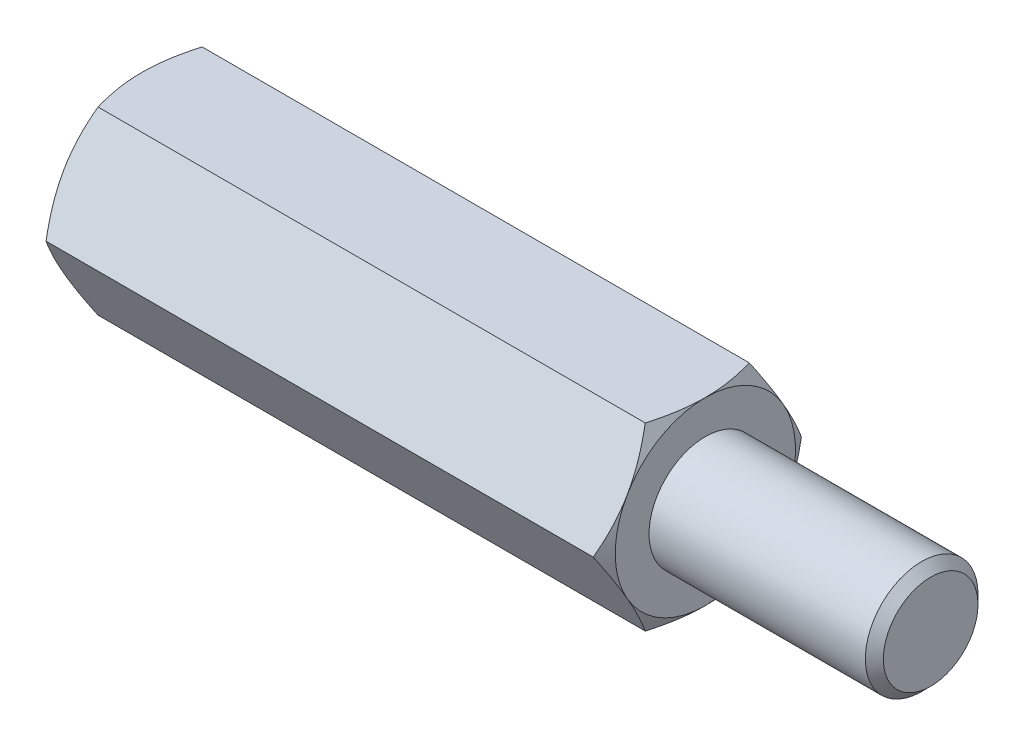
ISO-10303-21;
HEADER;
FILE_DESCRIPTION(('STEP AP214'),'2;1');
FILE_NAME('part.step','',(''),(''),'','','');
FILE_SCHEMA(('AUTOMOTIVE_DESIGN { 1 0 10303 214 1 1 1 1 }'));
ENDSEC;
DATA;
#1=APPLICATION_CONTEXT('core data for automotive mechanical design processes');
#2=APPLICATION_PROTOCOL_DEFINITION('international standard','automotive_design',2000,#1);
#3=PRODUCT_CONTEXT('',#1,'mechanical');
#4=PRODUCT('Part','Part','',(#3));
#5=PRODUCT_RELATED_PRODUCT_CATEGORY('part','',(#4));
#6=PRODUCT_DEFINITION_FORMATION('','',#4);
#7=PRODUCT_DEFINITION_CONTEXT('part definition',#1,'design');
#8=PRODUCT_DEFINITION('design','',#6,#7);
#9=PRODUCT_DEFINITION_SHAPE('','',#8);
#10=(LENGTH_UNIT() NAMED_UNIT(*) SI_UNIT(.MILLI.,.METRE.));
#11=(NAMED_UNIT(*) PLANE_ANGLE_UNIT() SI_UNIT($,.RADIAN.));
#12=(NAMED_UNIT(*) SI_UNIT($,.STERADIAN.) SOLID_ANGLE_UNIT());
#13=UNCERTAINTY_MEASURE_WITH_UNIT(LENGTH_MEASURE(1.E-05),#10,'distance_accuracy_value','');
#14=(GEOMETRIC_REPRESENTATION_CONTEXT(3) GLOBAL_UNCERTAINTY_ASSIGNED_CONTEXT((#13)) GLOBAL_UNIT_ASSIGNED_CONTEXT((#10,
#11,#12)) REPRESENTATION_CONTEXT('',''));
#15=CARTESIAN_POINT('',(0.,0.,0.));
#16=DIRECTION('',(0.,0.,1.));
#17=DIRECTION('',(1.,0.,0.));
#18=AXIS2_PLACEMENT_3D('',#15,#16,#17);
#19=CARTESIAN_POINT('',(12.5,4.,-2.3094010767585));
#20=DIRECTION('',(1.,0.,0.));
#21=DIRECTION('',(0.,0.,-1.));
#22=AXIS2_PLACEMENT_3D('',#19,#20,#21);
#23=PLANE('',#22);
#24=CARTESIAN_POINT('',(12.5,0.,0.));
#25=DIRECTION('',(1.,0.,0.));
#26=DIRECTION('',(0.,0.,-1.));
#27=AXIS2_PLACEMENT_3D('',#24,#25,#26);
#28=CIRCLE('',#27,4.);
#29=CARTESIAN_POINT('',(12.5,-2.,-3.46410161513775));
#30=VERTEX_POINT('',#29);
#31=CARTESIAN_POINT('',(12.5,2.,-3.46410161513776));
#32=VERTEX_POINT('',#31);
#33=EDGE_CURVE('E288',#30,#32,#28,.T.);
#34=ORIENTED_EDGE('',*,*,#33,.T.);
#35=CARTESIAN_POINT('',(12.5,4.,0.));
#36=VERTEX_POINT('',#35);
#37=EDGE_CURVE('E53',#32,#36,#28,.T.);
#38=ORIENTED_EDGE('',*,*,#37,.T.);
#39=CARTESIAN_POINT('',(12.5,2.,3.46410161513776));
#40=VERTEX_POINT('',#39);
#41=EDGE_CURVE('E297',#36,#40,#28,.T.);
#42=ORIENTED_EDGE('',*,*,#41,.T.);
#43=CARTESIAN_POINT('',(12.5,-2.,3.46410161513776));
#44=VERTEX_POINT('',#43);
#45=EDGE_CURVE('E303',#40,#44,#28,.T.);
#46=ORIENTED_EDGE('',*,*,#45,.T.);
#47=CARTESIAN_POINT('',(12.5,0.,0.));
#48=DIRECTION('',(-1.,0.,0.));
#49=DIRECTION('',(0.,-1.,0.));
#50=AXIS2_PLACEMENT_3D('',#47,#48,#49);
#51=CIRCLE('',#50,4.);
#52=CARTESIAN_POINT('',(12.5,-4.,0.));
#53=VERTEX_POINT('',#52);
#54=EDGE_CURVE('E193',#53,#44,#51,.T.);
#55=ORIENTED_EDGE('',*,*,#54,.F.);
#56=EDGE_CURVE('E61',#53,#30,#28,.T.);
#57=ORIENTED_EDGE('',*,*,#56,.T.);
#58=EDGE_LOOP('',(#34,#38,#42,#46,#55,#57));
#59=FACE_BOUND('',#58,.T.);
#60=CARTESIAN_POINT('',(12.5,0.,0.));
#61=DIRECTION('',(1.,0.,0.));
#62=DIRECTION('',(0.,0.,-1.));
#63=AXIS2_PLACEMENT_3D('',#60,#61,#62);
#64=CIRCLE('',#63,2.5);
#65=CARTESIAN_POINT('',(12.5,0.,-2.5));
#66=VERTEX_POINT('',#65);
#67=EDGE_CURVE('E458',#66,#66,#64,.T.);
#68=ORIENTED_EDGE('',*,*,#67,.F.);
#69=EDGE_LOOP('',(#68));
#70=FACE_BOUND('',#69,.T.);
#71=ADVANCED_FACE('F37',(#59,#70),#23,.T.);
#72=CARTESIAN_POINT('',(12.5,0.,-4.61880215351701));
#73=DIRECTION('',(0.,-0.5,0.866025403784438));
#74=DIRECTION('',(0.,-0.866025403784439,-0.5));
#75=AXIS2_PLACEMENT_3D('',#72,#73,#74);
#76=PLANE('',#75);
#77=CARTESIAN_POINT('',(12.1426677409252,-0.000200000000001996,-4.61891762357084));
#78=CARTESIAN_POINT('',(12.2012821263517,0.175579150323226,-4.5174314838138));
#79=CARTESIAN_POINT('',(12.2545896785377,0.352875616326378,-4.41506932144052));
#80=CARTESIAN_POINT('',(12.3476383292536,0.710538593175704,-4.2085725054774));
#81=CARTESIAN_POINT('',(12.3873465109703,0.890911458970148,-4.10443418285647));
#82=CARTESIAN_POINT('',(12.4491577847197,1.24942181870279,-3.89744813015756));
#83=CARTESIAN_POINT('',(12.4716722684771,1.42750415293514,-3.79463224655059));
#84=CARTESIAN_POINT('',(12.4985493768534,1.78450671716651,-3.58851671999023));
#85=CARTESIAN_POINT('',(12.5029342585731,1.9634256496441,-3.48521782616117));
#86=CARTESIAN_POINT('',(12.49380992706,2.29774284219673,-3.29219970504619));
#87=CARTESIAN_POINT('',(12.482541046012,2.45319115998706,-3.20245157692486));
#88=CARTESIAN_POINT('',(12.4468260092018,2.76307505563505,-3.02354002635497));
#89=CARTESIAN_POINT('',(12.4223676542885,2.91750956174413,-2.93437722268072));
#90=CARTESIAN_POINT('',(12.3612239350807,3.22803232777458,-2.75509682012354));
#91=CARTESIAN_POINT('',(12.3242793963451,3.3840812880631,-2.6650019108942));
#92=CARTESIAN_POINT('',(12.240429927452,3.69385183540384,-2.486155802));
#93=CARTESIAN_POINT('',(12.1935446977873,3.84757739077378,-2.39740231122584));
#94=CARTESIAN_POINT('',(12.1426677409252,4.0002,-2.30928560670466));
#95=B_SPLINE_CURVE_WITH_KNOTS('',3,(#77,#78,#79,#80,#81,#82,#83,#84,#85,#86,#87,#88,#89,#90,#91,
#92,#93,#94),.UNSPECIFIED.,.F.,.F.,(4,2,2,2,2,2,2,2,4),(0.,0.634047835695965,1.26961969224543,
1.88946157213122,2.50854226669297,3.04757825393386,3.58711366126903,4.13861653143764,
4.68903648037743),.UNSPECIFIED.);
#96=CARTESIAN_POINT('',(12.1427344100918,0.,-4.61880215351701));
#97=VERTEX_POINT('',#96);
#98=EDGE_CURVE('E341',#97,#32,#95,.T.);
#99=ORIENTED_EDGE('',*,*,#98,.F.);
#100=DIRECTION('',(-1.,0.,0.));
#101=VECTOR('',#100,1.);
#102=CARTESIAN_POINT('',(12.5,0.,-4.61880215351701));
#103=LINE('',#102,#101);
#104=CARTESIAN_POINT('',(-12.1427344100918,0.,-4.61880215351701));
#105=VERTEX_POINT('',#104);
#106=EDGE_CURVE('E264',#97,#105,#103,.T.);
#107=ORIENTED_EDGE('',*,*,#106,.T.);
#108=CARTESIAN_POINT('',(-12.1426677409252,4.0002,-2.30928560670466));
#109=CARTESIAN_POINT('',(-12.2012821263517,3.82442084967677,-2.4107717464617));
#110=CARTESIAN_POINT('',(-12.2545896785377,3.64712438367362,-2.51313390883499));
#111=CARTESIAN_POINT('',(-12.3476383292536,3.28946140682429,-2.71963072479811));
#112=CARTESIAN_POINT('',(-12.3873465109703,3.10908854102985,-2.82376904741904));
#113=CARTESIAN_POINT('',(-12.4491577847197,2.75057818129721,-3.03075510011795));
#114=CARTESIAN_POINT('',(-12.4716722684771,2.57249584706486,-3.13357098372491));
#115=CARTESIAN_POINT('',(-12.4985493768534,2.21549328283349,-3.33968651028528));
#116=CARTESIAN_POINT('',(-12.5029342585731,2.0365743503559,-3.44298540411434));
#117=CARTESIAN_POINT('',(-12.49380992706,1.70225715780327,-3.63600352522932));
#118=CARTESIAN_POINT('',(-12.482541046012,1.54680884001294,-3.72575165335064));
#119=CARTESIAN_POINT('',(-12.4468260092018,1.23692494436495,-3.90466320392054));
#120=CARTESIAN_POINT('',(-12.4223676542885,1.08249043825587,-3.99382600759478));
#121=CARTESIAN_POINT('',(-12.3612239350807,0.771967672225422,-4.17310641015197));
#122=CARTESIAN_POINT('',(-12.3242793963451,0.615918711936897,-4.26320131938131));
#123=CARTESIAN_POINT('',(-12.240429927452,0.30614816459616,-4.4420474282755));
#124=CARTESIAN_POINT('',(-12.1935446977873,0.152422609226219,-4.53080091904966));
#125=CARTESIAN_POINT('',(-12.1426677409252,-0.000200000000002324,-4.61891762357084));
#126=B_SPLINE_CURVE_WITH_KNOTS('',3,(#108,#109,#110,#111,#112,#113,#114,#115,#116,#117,#118,
#119,#120,#121,#122,#123,#124,#125),.UNSPECIFIED.,.F.,.F.,(4,2,2,2,2,2,2,2,4),(0.,
0.634047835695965,1.26961969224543,1.88946157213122,2.50854226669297,3.04757825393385,
3.58711366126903,4.13861653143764,4.68903648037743),.UNSPECIFIED.);
#127=CARTESIAN_POINT('',(-12.5,2.,-3.46410161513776));
#128=VERTEX_POINT('',#127);
#129=EDGE_CURVE('E381',#128,#105,#126,.T.);
#130=ORIENTED_EDGE('',*,*,#129,.F.);
#131=CARTESIAN_POINT('',(-12.1427344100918,4.,-2.3094010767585));
#132=VERTEX_POINT('',#131);
#133=EDGE_CURVE('E377',#132,#128,#126,.T.);
#134=ORIENTED_EDGE('',*,*,#133,.F.);
#135=DIRECTION('',(-1.,0.,0.));
#136=VECTOR('',#135,1.);
#137=CARTESIAN_POINT('',(12.5,4.,-2.3094010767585));
#138=LINE('',#137,#136);
#139=CARTESIAN_POINT('',(12.142734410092,4.,-2.30940107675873));
#140=VERTEX_POINT('',#139);
#141=EDGE_CURVE('E279',#140,#132,#138,.T.);
#142=ORIENTED_EDGE('',*,*,#141,.F.);
#143=EDGE_CURVE('E229',#32,#140,#95,.T.);
#144=ORIENTED_EDGE('',*,*,#143,.F.);
#145=EDGE_LOOP('',(#99,#107,#130,#134,#142,#144));
#146=FACE_BOUND('',#145,.T.);
#147=ADVANCED_FACE('F148',(#146),#76,.F.);
#148=CARTESIAN_POINT('',(12.5,4.,-2.3094010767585));
#149=DIRECTION('',(0.,-1.,0.));
#150=DIRECTION('',(0.,0.,-1.));
#151=AXIS2_PLACEMENT_3D('',#148,#149,#150);
#152=PLANE('',#151);
#153=CARTESIAN_POINT('',(10.5082907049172,4.,-6.28479524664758));
#154=CARTESIAN_POINT('',(10.5937006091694,4.,-6.10939349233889));
#155=CARTESIAN_POINT('',(10.6783148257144,4.,-5.93359774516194));
#156=CARTESIAN_POINT('',(10.8455059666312,4.,-5.58100905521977));
#157=CARTESIAN_POINT('',(10.9280825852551,4.,-5.40421596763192));
#158=CARTESIAN_POINT('',(11.0911508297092,4.,-5.04855089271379));
#159=CARTESIAN_POINT('',(11.1716293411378,4.,-4.86967287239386));
#160=CARTESIAN_POINT('',(11.329400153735,4.,-4.51052237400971));
#161=CARTESIAN_POINT('',(11.406692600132,4.,-4.33024995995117));
#162=CARTESIAN_POINT('',(11.559802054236,4.,-3.96189114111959));
#163=CARTESIAN_POINT('',(11.635480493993,4.,-3.77374683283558));
#164=CARTESIAN_POINT('',(11.7813045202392,4.,-3.39528725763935));
#165=CARTESIAN_POINT('',(11.8514494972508,4.,-3.2049717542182));
#166=CARTESIAN_POINT('',(11.9844245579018,4.,-2.82219775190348));
#167=CARTESIAN_POINT('',(12.0472687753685,4.,-2.62974421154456));
#168=CARTESIAN_POINT('',(12.1636796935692,4.,-2.24207725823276));
#169=CARTESIAN_POINT('',(12.2172492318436,4.,-2.04686470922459));
#170=CARTESIAN_POINT('',(12.3123031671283,4.,-1.65467425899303));
#171=CARTESIAN_POINT('',(12.3538563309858,4.,-1.45771333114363));
#172=CARTESIAN_POINT('',(12.4225903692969,4.,-1.06125849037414));
#173=CARTESIAN_POINT('',(12.4497727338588,4.,-0.861764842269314));
#174=CARTESIAN_POINT('',(12.4872447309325,4.,-0.463879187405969));
#175=CARTESIAN_POINT('',(12.4977578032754,4.,-0.265508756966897));
#176=CARTESIAN_POINT('',(12.5015934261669,4.,0.131417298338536));
#177=CARTESIAN_POINT('',(12.4949158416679,4.,0.329972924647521));
#178=CARTESIAN_POINT('',(12.4696489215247,4.,0.664692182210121));
#179=CARTESIAN_POINT('',(12.4553708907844,4.,0.801202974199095));
#180=CARTESIAN_POINT('',(12.4195349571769,4.,1.07327201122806));
#181=CARTESIAN_POINT('',(12.3979761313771,4.,1.20883013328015));
#182=CARTESIAN_POINT('',(12.3235066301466,4.,1.61386939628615));
#183=CARTESIAN_POINT('',(12.2608149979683,4.,1.8815748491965));
#184=CARTESIAN_POINT('',(12.1515117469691,4.,2.28197262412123));
#185=CARTESIAN_POINT('',(12.112009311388,4.,2.41672443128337));
#186=CARTESIAN_POINT('',(12.0287523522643,4.,2.68492067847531));
#187=CARTESIAN_POINT('',(11.9849977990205,4.,2.81836510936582));
#188=CARTESIAN_POINT('',(11.8939510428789,4.,3.0839859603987));
#189=CARTESIAN_POINT('',(11.846659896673,4.,3.21616274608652));
#190=CARTESIAN_POINT('',(11.7491111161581,4.,3.47941134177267));
#191=CARTESIAN_POINT('',(11.6988535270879,4.,3.61048316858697));
#192=CARTESIAN_POINT('',(11.5713295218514,4.,3.93385125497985));
#193=CARTESIAN_POINT('',(11.4926014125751,4.,4.1255702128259));
#194=CARTESIAN_POINT('',(11.3309693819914,4.,4.5072455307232));
#195=CARTESIAN_POINT('',(11.2480651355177,4.,4.69720175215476));
#196=CARTESIAN_POINT('',(11.0789699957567,4.,5.0756995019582));
#197=CARTESIAN_POINT('',(10.9927782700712,4.,5.264240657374));
#198=CARTESIAN_POINT('',(10.8178011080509,4.,5.64011758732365));
#199=CARTESIAN_POINT('',(10.7290156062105,4.,5.82745333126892));
#200=CARTESIAN_POINT('',(10.4593432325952,4.,6.3884442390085));
#201=CARTESIAN_POINT('',(10.2753561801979,4.,6.76060781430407));
#202=CARTESIAN_POINT('',(9.9019562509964,4.,7.50211228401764));
#203=CARTESIAN_POINT('',(9.7125442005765,4.,7.87145359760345));
#204=CARTESIAN_POINT('',(9.34738774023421,4.,8.57450173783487));
#205=CARTESIAN_POINT('',(9.17197556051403,4.,8.90838144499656));
#206=CARTESIAN_POINT('',(8.81880976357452,4.,9.57491712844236));
#207=CARTESIAN_POINT('',(8.64105604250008,4.,9.9075730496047));
#208=CARTESIAN_POINT('',(8.28429339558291,4.,10.5709822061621));
#209=CARTESIAN_POINT('',(8.10528952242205,3.99999999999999,10.9017381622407));
#210=CARTESIAN_POINT('',(7.74590712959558,3.99999999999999,11.5624752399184));
#211=CARTESIAN_POINT('',(7.56552869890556,3.99999999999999,11.8924564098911));
#212=CARTESIAN_POINT('',(7.38464248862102,3.99999999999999,12.2221569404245));
#213=B_SPLINE_CURVE_WITH_KNOTS('',3,(#153,#154,#155,#156,#157,#158,#159,#160,#161,#162,#163,
#164,#165,#166,#167,#168,#169,#170,#171,#172,#173,#174,#175,#176,#177,#178,#179,#180,#181,#182,
#183,#184,#185,#186,#187,#188,#189,#190,#191,#192,#193,#194,#195,#196,#197,#198,#199,#200,#201,
#202,#203,#204,#205,#206,#207,#208,#209,#210,#211,#212),.UNSPECIFIED.,.F.,.F.,(4,2,2,2,2,2,2,2,
2,2,2,2,2,2,2,2,2,2,2,2,2,2,2,2,2,2,2,2,2,4),(0.,0.585280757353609,1.17064881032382,
1.75906864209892,2.34746162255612,2.95577704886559,3.56415938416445,4.17134357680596,
4.77834167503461,5.38179402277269,5.98518378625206,6.58041501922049,7.17565092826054,
7.5872191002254,7.99883946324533,8.82250155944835,9.24373134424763,9.66496407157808,
10.086071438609,10.5071723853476,11.1288656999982,11.7506074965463,12.3725077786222,
12.9944237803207,14.2398211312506,15.4850297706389,16.6164791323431,17.7479788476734,
18.8762380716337,20.0044248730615),.UNSPECIFIED.);
#214=EDGE_CURVE('E227',#140,#36,#213,.T.);
#215=ORIENTED_EDGE('',*,*,#214,.F.);
#216=ORIENTED_EDGE('',*,*,#141,.T.);
#217=CARTESIAN_POINT('',(-10.5082907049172,4.,-6.28479524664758));
#218=CARTESIAN_POINT('',(-10.5937006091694,4.,-6.10939349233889));
#219=CARTESIAN_POINT('',(-10.6783148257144,4.,-5.93359774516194));
#220=CARTESIAN_POINT('',(-10.8455059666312,4.,-5.58100905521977));
#221=CARTESIAN_POINT('',(-10.9280825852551,4.,-5.40421596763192));
#222=CARTESIAN_POINT('',(-11.0911508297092,4.,-5.04855089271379));
#223=CARTESIAN_POINT('',(-11.1716293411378,4.,-4.86967287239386));
#224=CARTESIAN_POINT('',(-11.329400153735,4.,-4.51052237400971));
#225=CARTESIAN_POINT('',(-11.406692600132,4.,-4.33024995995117));
#226=CARTESIAN_POINT('',(-11.559802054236,4.,-3.96189114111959));
#227=CARTESIAN_POINT('',(-11.635480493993,4.,-3.77374683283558));
#228=CARTESIAN_POINT('',(-11.7813045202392,4.,-3.39528725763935));
#229=CARTESIAN_POINT('',(-11.8514494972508,4.,-3.2049717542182));
#230=CARTESIAN_POINT('',(-11.9844245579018,4.,-2.82219775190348));
#231=CARTESIAN_POINT('',(-12.0472687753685,4.,-2.62974421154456));
#232=CARTESIAN_POINT('',(-12.1636796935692,4.,-2.24207725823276));
#233=CARTESIAN_POINT('',(-12.2172492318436,4.,-2.04686470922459));
#234=CARTESIAN_POINT('',(-12.3123031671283,4.,-1.65467425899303));
#235=CARTESIAN_POINT('',(-12.3538563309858,4.,-1.45771333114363));
#236=CARTESIAN_POINT('',(-12.4225903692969,4.,-1.06125849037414));
#237=CARTESIAN_POINT('',(-12.4497727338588,4.,-0.861764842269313));
#238=CARTESIAN_POINT('',(-12.4872447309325,4.,-0.463879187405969));
#239=CARTESIAN_POINT('',(-12.4977578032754,4.,-0.265508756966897));
#240=CARTESIAN_POINT('',(-12.5015934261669,4.,0.131417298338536));
#241=CARTESIAN_POINT('',(-12.4949158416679,4.,0.329972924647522));
#242=CARTESIAN_POINT('',(-12.4696489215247,4.,0.664692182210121));
#243=CARTESIAN_POINT('',(-12.4553708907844,4.,0.801202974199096));
#244=CARTESIAN_POINT('',(-12.4195349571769,4.,1.07327201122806));
#245=CARTESIAN_POINT('',(-12.3979761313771,4.,1.20883013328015));
#246=CARTESIAN_POINT('',(-12.3235066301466,4.,1.61386939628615));
#247=CARTESIAN_POINT('',(-12.2608149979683,4.,1.8815748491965));
#248=CARTESIAN_POINT('',(-12.1515117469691,4.,2.28197262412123));
#249=CARTESIAN_POINT('',(-12.112009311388,4.,2.41672443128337));
#250=CARTESIAN_POINT('',(-12.0287523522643,4.,2.68492067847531));
#251=CARTESIAN_POINT('',(-11.9849977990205,4.,2.81836510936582));
#252=CARTESIAN_POINT('',(-11.8939510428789,4.,3.0839859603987));
#253=CARTESIAN_POINT('',(-11.846659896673,4.,3.21616274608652));
#254=CARTESIAN_POINT('',(-11.7491111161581,4.,3.47941134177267));
#255=CARTESIAN_POINT('',(-11.6988535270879,4.,3.61048316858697));
#256=CARTESIAN_POINT('',(-11.5713295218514,4.,3.93385125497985));
#257=CARTESIAN_POINT('',(-11.4926014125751,4.,4.1255702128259));
#258=CARTESIAN_POINT('',(-11.3309693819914,4.,4.5072455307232));
#259=CARTESIAN_POINT('',(-11.2480651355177,4.,4.69720175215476));
#260=CARTESIAN_POINT('',(-11.0789699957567,4.,5.0756995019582));
#261=CARTESIAN_POINT('',(-10.9927782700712,4.,5.264240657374));
#262=CARTESIAN_POINT('',(-10.8178011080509,4.,5.64011758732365));
#263=CARTESIAN_POINT('',(-10.7290156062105,4.,5.82745333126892));
#264=CARTESIAN_POINT('',(-10.4593432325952,4.,6.3884442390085));
#265=CARTESIAN_POINT('',(-10.2753561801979,4.,6.76060781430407));
#266=CARTESIAN_POINT('',(-9.9019562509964,4.,7.50211228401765));
#267=CARTESIAN_POINT('',(-9.7125442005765,4.,7.87145359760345));
#268=CARTESIAN_POINT('',(-9.34738774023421,4.,8.57450173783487));
#269=CARTESIAN_POINT('',(-9.17197556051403,4.,8.90838144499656));
#270=CARTESIAN_POINT('',(-8.81880976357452,4.,9.57491712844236));
#271=CARTESIAN_POINT('',(-8.64105604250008,4.,9.9075730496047));
#272=CARTESIAN_POINT('',(-8.28429339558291,4.,10.5709822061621));
#273=CARTESIAN_POINT('',(-8.10528952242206,3.99999999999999,10.9017381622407));
#274=CARTESIAN_POINT('',(-7.74590712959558,3.99999999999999,11.5624752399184));
#275=CARTESIAN_POINT('',(-7.56552869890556,3.99999999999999,11.8924564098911));
#276=CARTESIAN_POINT('',(-7.38464248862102,3.99999999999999,12.2221569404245));
#277=B_SPLINE_CURVE_WITH_KNOTS('',3,(#217,#218,#219,#220,#221,#222,#223,#224,#225,#226,#227,
#228,#229,#230,#231,#232,#233,#234,#235,#236,#237,#238,#239,#240,#241,#242,#243,#244,#245,#246,
#247,#248,#249,#250,#251,#252,#253,#254,#255,#256,#257,#258,#259,#260,#261,#262,#263,#264,#265,
#266,#267,#268,#269,#270,#271,#272,#273,#274,#275,#276),.UNSPECIFIED.,.F.,.F.,(4,2,2,2,2,2,2,2,
2,2,2,2,2,2,2,2,2,2,2,2,2,2,2,2,2,2,2,2,2,4),(0.,0.585280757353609,1.17064881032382,
1.75906864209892,2.34746162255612,2.95577704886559,3.56415938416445,4.17134357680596,
4.77834167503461,5.38179402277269,5.98518378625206,6.58041501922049,7.17565092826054,
7.5872191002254,7.99883946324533,8.82250155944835,9.24373134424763,9.66496407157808,
10.086071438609,10.5071723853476,11.1288656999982,11.7506074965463,12.3725077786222,
12.9944237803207,14.2398211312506,15.4850297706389,16.6164791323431,17.7479788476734,
18.8762380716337,20.0044248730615),.UNSPECIFIED.);
#278=CARTESIAN_POINT('',(-12.5,4.,0.));
#279=VERTEX_POINT('',#278);
#280=EDGE_CURVE('E241',#279,#132,#277,.F.);
#281=ORIENTED_EDGE('',*,*,#280,.F.);
#282=CARTESIAN_POINT('',(-12.1427344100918,4.,2.3094010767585));
#283=VERTEX_POINT('',#282);
#284=EDGE_CURVE('E249',#283,#279,#277,.F.);
#285=ORIENTED_EDGE('',*,*,#284,.F.);
#286=DIRECTION('',(-1.,0.,0.));
#287=VECTOR('',#286,1.);
#288=CARTESIAN_POINT('',(12.5,4.,2.3094010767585));
#289=LINE('',#288,#287);
#290=CARTESIAN_POINT('',(12.1427344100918,4.,2.3094010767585));
#291=VERTEX_POINT('',#290);
#292=EDGE_CURVE('E276',#291,#283,#289,.T.);
#293=ORIENTED_EDGE('',*,*,#292,.F.);
#294=EDGE_CURVE('E221',#36,#291,#213,.T.);
#295=ORIENTED_EDGE('',*,*,#294,.F.);
#296=EDGE_LOOP('',(#215,#216,#281,#285,#293,#295));
#297=FACE_BOUND('',#296,.T.);
#298=ADVANCED_FACE('F153',(#297),#152,.F.);
#299=CARTESIAN_POINT('',(12.5,4.,2.3094010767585));
#300=DIRECTION('',(0.,-0.5,-0.866025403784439));
#301=DIRECTION('',(0.,0.866025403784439,-0.5));
#302=AXIS2_PLACEMENT_3D('',#299,#300,#301);
#303=PLANE('',#302);
#304=CARTESIAN_POINT('',(12.1426677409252,4.0002,2.30928560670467));
#305=CARTESIAN_POINT('',(12.2012821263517,3.82442084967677,2.4107717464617));
#306=CARTESIAN_POINT('',(12.2545896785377,3.64712438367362,2.51313390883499));
#307=CARTESIAN_POINT('',(12.3476383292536,3.28946140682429,2.71963072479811));
#308=CARTESIAN_POINT('',(12.3873465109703,3.10908854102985,2.82376904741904));
#309=CARTESIAN_POINT('',(12.4491577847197,2.75057818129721,3.03075510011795));
#310=CARTESIAN_POINT('',(12.4716722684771,2.57249584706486,3.13357098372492));
#311=CARTESIAN_POINT('',(12.4985493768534,2.21549328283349,3.33968651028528));
#312=CARTESIAN_POINT('',(12.5029342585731,2.0365743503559,3.44298540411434));
#313=CARTESIAN_POINT('',(12.49380992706,1.70225715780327,3.63600352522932));
#314=CARTESIAN_POINT('',(12.482541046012,1.54680884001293,3.72575165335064));
#315=CARTESIAN_POINT('',(12.4468260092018,1.23692494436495,3.90466320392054));
#316=CARTESIAN_POINT('',(12.4223676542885,1.08249043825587,3.99382600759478));
#317=CARTESIAN_POINT('',(12.3612239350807,0.771967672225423,4.17310641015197));
#318=CARTESIAN_POINT('',(12.3242793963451,0.615918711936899,4.26320131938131));
#319=CARTESIAN_POINT('',(12.240429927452,0.306148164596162,4.4420474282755));
#320=CARTESIAN_POINT('',(12.1935446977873,0.152422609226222,4.53080091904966));
#321=CARTESIAN_POINT('',(12.1426677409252,-0.0001999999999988,4.61891762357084));
#322=B_SPLINE_CURVE_WITH_KNOTS('',3,(#304,#305,#306,#307,#308,#309,#310,#311,#312,#313,#314,
#315,#316,#317,#318,#319,#320,#321),.UNSPECIFIED.,.F.,.F.,(4,2,2,2,2,2,2,2,4),(0.,
0.634047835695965,1.26961969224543,1.88946157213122,2.50854226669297,3.04757825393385,
3.58711366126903,4.13861653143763,4.68903648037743),.UNSPECIFIED.);
#323=EDGE_CURVE('E228',#291,#40,#322,.T.);
#324=ORIENTED_EDGE('',*,*,#323,.F.);
#325=ORIENTED_EDGE('',*,*,#292,.T.);
#326=CARTESIAN_POINT('',(-12.1426677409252,-0.000199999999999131,4.61891762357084));
#327=CARTESIAN_POINT('',(-12.2012821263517,0.175579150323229,4.5174314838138));
#328=CARTESIAN_POINT('',(-12.2545896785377,0.352875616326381,4.41506932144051));
#329=CARTESIAN_POINT('',(-12.3476383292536,0.710538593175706,4.20857250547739));
#330=CARTESIAN_POINT('',(-12.3873465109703,0.890911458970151,4.10443418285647));
#331=CARTESIAN_POINT('',(-12.4491577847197,1.24942181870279,3.89744813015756));
#332=CARTESIAN_POINT('',(-12.4716722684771,1.42750415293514,3.79463224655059));
#333=CARTESIAN_POINT('',(-12.4985493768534,1.78450671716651,3.58851671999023));
#334=CARTESIAN_POINT('',(-12.5029342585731,1.9634256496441,3.48521782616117));
#335=CARTESIAN_POINT('',(-12.49380992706,2.29774284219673,3.29219970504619));
#336=CARTESIAN_POINT('',(-12.482541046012,2.45319115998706,3.20245157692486));
#337=CARTESIAN_POINT('',(-12.4468260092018,2.76307505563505,3.02354002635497));
#338=CARTESIAN_POINT('',(-12.4223676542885,2.91750956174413,2.93437722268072));
#339=CARTESIAN_POINT('',(-12.3612239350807,3.22803232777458,2.75509682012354));
#340=CARTESIAN_POINT('',(-12.3242793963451,3.3840812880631,2.6650019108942));
#341=CARTESIAN_POINT('',(-12.240429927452,3.69385183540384,2.48615580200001));
#342=CARTESIAN_POINT('',(-12.1935446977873,3.84757739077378,2.39740231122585));
#343=CARTESIAN_POINT('',(-12.1426677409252,4.0002,2.30928560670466));
#344=B_SPLINE_CURVE_WITH_KNOTS('',3,(#326,#327,#328,#329,#330,#331,#332,#333,#334,#335,#336,
#337,#338,#339,#340,#341,#342,#343),.UNSPECIFIED.,.F.,.F.,(4,2,2,2,2,2,2,2,4),(0.,
0.634047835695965,1.26961969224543,1.88946157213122,2.50854226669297,3.04757825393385,
3.58711366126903,4.13861653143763,4.68903648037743),.UNSPECIFIED.);
#345=CARTESIAN_POINT('',(-12.5,2.,3.46410161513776));
#346=VERTEX_POINT('',#345);
#347=EDGE_CURVE('E255',#346,#283,#344,.T.);
#348=ORIENTED_EDGE('',*,*,#347,.F.);
#349=CARTESIAN_POINT('',(-12.1427344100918,0.,4.618802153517));
#350=VERTEX_POINT('',#349);
#351=EDGE_CURVE('E262',#350,#346,#344,.T.);
#352=ORIENTED_EDGE('',*,*,#351,.F.);
#353=DIRECTION('',(-1.,0.,0.));
#354=VECTOR('',#353,1.);
#355=CARTESIAN_POINT('',(12.5,0.,4.618802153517));
#356=LINE('',#355,#354);
#357=CARTESIAN_POINT('',(12.1427344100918,0.,4.618802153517));
#358=VERTEX_POINT('',#357);
#359=EDGE_CURVE('E273',#358,#350,#356,.T.);
#360=ORIENTED_EDGE('',*,*,#359,.F.);
#361=EDGE_CURVE('E215',#40,#358,#322,.T.);
#362=ORIENTED_EDGE('',*,*,#361,.F.);
#363=EDGE_LOOP('',(#324,#325,#348,#352,#360,#362));
#364=FACE_BOUND('',#363,.T.);
#365=ADVANCED_FACE('F235',(#364),#303,.F.);
#366=CARTESIAN_POINT('',(12.5,0.,4.618802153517));
#367=DIRECTION('',(0.,0.5,-0.866025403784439));
#368=DIRECTION('',(0.,0.866025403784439,0.5));
#369=AXIS2_PLACEMENT_3D('',#366,#367,#368);
#370=PLANE('',#369);
#371=CARTESIAN_POINT('',(12.1426677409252,0.000200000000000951,4.61891762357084));
#372=CARTESIAN_POINT('',(12.2012821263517,-0.175579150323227,4.5174314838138));
#373=CARTESIAN_POINT('',(12.2545896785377,-0.35287561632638,4.41506932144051));
#374=CARTESIAN_POINT('',(12.3476383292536,-0.710538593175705,4.20857250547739));
#375=CARTESIAN_POINT('',(12.3873465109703,-0.890911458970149,4.10443418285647));
#376=CARTESIAN_POINT('',(12.4491577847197,-1.24942181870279,3.89744813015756));
#377=CARTESIAN_POINT('',(12.4716722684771,-1.42750415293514,3.79463224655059));
#378=CARTESIAN_POINT('',(12.4985493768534,-1.78450671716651,3.58851671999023));
#379=CARTESIAN_POINT('',(12.5029342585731,-1.9634256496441,3.48521782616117));
#380=CARTESIAN_POINT('',(12.49380992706,-2.29774284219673,3.29219970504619));
#381=CARTESIAN_POINT('',(12.482541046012,-2.45319115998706,3.20245157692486));
#382=CARTESIAN_POINT('',(12.4468260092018,-2.76307505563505,3.02354002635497));
#383=CARTESIAN_POINT('',(12.4223676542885,-2.91750956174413,2.93437722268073));
#384=CARTESIAN_POINT('',(12.3612239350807,-3.22803232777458,2.75509682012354));
#385=CARTESIAN_POINT('',(12.3242793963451,-3.3840812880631,2.6650019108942));
#386=CARTESIAN_POINT('',(12.240429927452,-3.69385183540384,2.48615580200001));
#387=CARTESIAN_POINT('',(12.1935446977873,-3.84757739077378,2.39740231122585));
#388=CARTESIAN_POINT('',(12.1426677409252,-4.0002,2.30928560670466));
#389=B_SPLINE_CURVE_WITH_KNOTS('',3,(#371,#372,#373,#374,#375,#376,#377,#378,#379,#380,#381,
#382,#383,#384,#385,#386,#387,#388),.UNSPECIFIED.,.F.,.F.,(4,2,2,2,2,2,2,2,4),(0.,
0.634047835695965,1.26961969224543,1.88946157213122,2.50854226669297,3.04757825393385,
3.58711366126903,4.13861653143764,4.68903648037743),.UNSPECIFIED.);
#390=EDGE_CURVE('E320',#358,#44,#389,.T.);
#391=ORIENTED_EDGE('',*,*,#390,.F.);
#392=ORIENTED_EDGE('',*,*,#359,.T.);
#393=CARTESIAN_POINT('',(-12.1426677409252,-4.0002,2.30928560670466));
#394=CARTESIAN_POINT('',(-12.2012821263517,-3.82442084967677,2.4107717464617));
#395=CARTESIAN_POINT('',(-12.2545896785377,-3.64712438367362,2.51313390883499));
#396=CARTESIAN_POINT('',(-12.3476383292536,-3.28946140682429,2.71963072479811));
#397=CARTESIAN_POINT('',(-12.3873465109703,-3.10908854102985,2.82376904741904));
#398=CARTESIAN_POINT('',(-12.4491577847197,-2.75057818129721,3.03075510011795));
#399=CARTESIAN_POINT('',(-12.4716722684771,-2.57249584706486,3.13357098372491));
#400=CARTESIAN_POINT('',(-12.4985493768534,-2.21549328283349,3.33968651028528));
#401=CARTESIAN_POINT('',(-12.5029342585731,-2.0365743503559,3.44298540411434));
#402=CARTESIAN_POINT('',(-12.49380992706,-1.70225715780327,3.63600352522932));
#403=CARTESIAN_POINT('',(-12.482541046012,-1.54680884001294,3.72575165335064));
#404=CARTESIAN_POINT('',(-12.4468260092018,-1.23692494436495,3.90466320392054));
#405=CARTESIAN_POINT('',(-12.4223676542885,-1.08249043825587,3.99382600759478));
#406=CARTESIAN_POINT('',(-12.3612239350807,-0.771967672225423,4.17310641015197));
#407=CARTESIAN_POINT('',(-12.3242793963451,-0.615918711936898,4.26320131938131));
#408=CARTESIAN_POINT('',(-12.240429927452,-0.306148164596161,4.4420474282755));
#409=CARTESIAN_POINT('',(-12.1935446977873,-0.15242260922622,4.53080091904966));
#410=CARTESIAN_POINT('',(-12.1426677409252,0.000200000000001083,4.61891762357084));
#411=B_SPLINE_CURVE_WITH_KNOTS('',3,(#393,#394,#395,#396,#397,#398,#399,#400,#401,#402,#403,
#404,#405,#406,#407,#408,#409,#410),.UNSPECIFIED.,.F.,.F.,(4,2,2,2,2,2,2,2,4),(0.,
0.634047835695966,1.26961969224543,1.88946157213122,2.50854226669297,3.04757825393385,
3.58711366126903,4.13861653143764,4.68903648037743),.UNSPECIFIED.);
#412=CARTESIAN_POINT('',(-12.5,-2.,3.46410161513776));
#413=VERTEX_POINT('',#412);
#414=EDGE_CURVE('E263',#413,#350,#411,.T.);
#415=ORIENTED_EDGE('',*,*,#414,.F.);
#416=CARTESIAN_POINT('',(-12.1427344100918,-4.,2.3094010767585));
#417=VERTEX_POINT('',#416);
#418=EDGE_CURVE('E250',#417,#413,#411,.T.);
#419=ORIENTED_EDGE('',*,*,#418,.F.);
#420=DIRECTION('',(-1.,0.,0.));
#421=VECTOR('',#420,1.);
#422=CARTESIAN_POINT('',(12.5,-4.,2.3094010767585));
#423=LINE('',#422,#421);
#424=CARTESIAN_POINT('',(12.1427344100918,-4.,2.3094010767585));
#425=VERTEX_POINT('',#424);
#426=EDGE_CURVE('E270',#425,#417,#423,.T.);
#427=ORIENTED_EDGE('',*,*,#426,.F.);
#428=EDGE_CURVE('E210',#44,#425,#389,.T.);
#429=ORIENTED_EDGE('',*,*,#428,.F.);
#430=EDGE_LOOP('',(#391,#392,#415,#419,#427,#429));
#431=FACE_BOUND('',#430,.T.);
#432=ADVANCED_FACE('F319',(#431),#370,.F.);
#433=CARTESIAN_POINT('',(12.5,-4.,2.3094010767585));
#434=DIRECTION('',(0.,1.,0.));
#435=DIRECTION('',(0.,0.,1.));
#436=AXIS2_PLACEMENT_3D('',#433,#434,#435);
#437=PLANE('',#436);
#438=CARTESIAN_POINT('',(10.5082907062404,-4.,-6.28479524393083));
#439=CARTESIAN_POINT('',(10.5937006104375,-4.,-6.10939348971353));
#440=CARTESIAN_POINT('',(10.6783148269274,-4.,-5.93359774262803));
#441=CARTESIAN_POINT('',(10.8455059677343,-4.,-5.58100905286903));
#442=CARTESIAN_POINT('',(10.9280825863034,-4.,-5.40421596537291));
#443=CARTESIAN_POINT('',(11.0911508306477,-4.,-5.04855089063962));
#444=CARTESIAN_POINT('',(11.1716293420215,-4.,-4.86967287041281));
#445=CARTESIAN_POINT('',(11.3294001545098,-4.,-4.51052237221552));
#446=CARTESIAN_POINT('',(11.4066926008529,-4.,-4.33024995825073));
#447=CARTESIAN_POINT('',(11.5598020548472,-4.,-3.96189113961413));
#448=CARTESIAN_POINT('',(11.6354804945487,-4.,-3.77374683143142));
#449=CARTESIAN_POINT('',(11.7813045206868,-4.,-3.39528725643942));
#450=CARTESIAN_POINT('',(11.8514494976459,-4.,-3.20497175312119));
#451=CARTESIAN_POINT('',(11.9844245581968,-4.,-2.82219775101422));
#452=CARTESIAN_POINT('',(12.0472687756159,-4.,-2.62974421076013));
#453=CARTESIAN_POINT('',(12.1636796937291,-4.,-2.24207725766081));
#454=CARTESIAN_POINT('',(12.2172492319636,-4.,-2.04686470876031));
#455=CARTESIAN_POINT('',(12.3123031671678,-4.,-1.65467425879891));
#456=CARTESIAN_POINT('',(12.3538563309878,-4.,-1.45771333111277));
#457=CARTESIAN_POINT('',(12.4225903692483,-4.,-1.06125849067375));
#458=CARTESIAN_POINT('',(12.4497727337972,-4.,-0.861764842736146));
#459=CARTESIAN_POINT('',(12.4872447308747,-4.,-0.463879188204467));
#460=CARTESIAN_POINT('',(12.4977578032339,-4.,-0.265508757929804));
#461=CARTESIAN_POINT('',(12.5015934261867,-4.,0.13141729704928));
#462=CARTESIAN_POINT('',(12.4949158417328,-4.,0.329972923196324));
#463=CARTESIAN_POINT('',(12.4696489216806,-4.,0.664692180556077));
#464=CARTESIAN_POINT('',(12.4553708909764,-4.,0.80120297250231));
#465=CARTESIAN_POINT('',(12.4195349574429,-4.,1.07327200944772));
#466=CARTESIAN_POINT('',(12.3979761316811,-4.,1.208830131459));
#467=CARTESIAN_POINT('',(12.3235066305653,-4.,1.6138693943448));
#468=CARTESIAN_POINT('',(12.2608149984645,-4.,1.88157484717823));
#469=CARTESIAN_POINT('',(12.1515117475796,-4.,2.28197262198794));
#470=CARTESIAN_POINT('',(12.1120093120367,-4.,2.41672442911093));
#471=CARTESIAN_POINT('',(12.0287523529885,-4.,2.68492067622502));
#472=CARTESIAN_POINT('',(11.9849977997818,-4.,2.81836510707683));
#473=CARTESIAN_POINT('',(11.8939510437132,-4.,3.0839859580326));
#474=CARTESIAN_POINT('',(11.8466598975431,-4.,3.21616274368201));
#475=CARTESIAN_POINT('',(11.7491111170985,-4.,3.47941133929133));
#476=CARTESIAN_POINT('',(11.6988535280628,-4.,3.61048316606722));
#477=CARTESIAN_POINT('',(11.5713295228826,-4.,3.93385125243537));
#478=CARTESIAN_POINT('',(11.4926014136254,-4.,4.12557021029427));
#479=CARTESIAN_POINT('',(11.330969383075,-4.,4.50724552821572));
#480=CARTESIAN_POINT('',(11.2480651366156,-4.,4.69720174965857));
#481=CARTESIAN_POINT('',(11.0789699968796,-4.,5.07569949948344));
#482=CARTESIAN_POINT('',(10.9927782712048,-4.,5.26424065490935));
#483=CARTESIAN_POINT('',(10.8178011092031,-4.,5.64011758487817));
#484=CARTESIAN_POINT('',(10.7290156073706,-4.,5.82745332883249));
#485=CARTESIAN_POINT('',(10.4593432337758,-4.,6.38844423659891));
#486=CARTESIAN_POINT('',(10.275356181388,-4.,6.76060781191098));
#487=CARTESIAN_POINT('',(9.90195625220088,-4.,7.50211228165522));
#488=CARTESIAN_POINT('',(9.71254420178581,-4.,7.87145359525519));
#489=CARTESIAN_POINT('',(9.34738774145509,-4.,8.57450173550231));
#490=CARTESIAN_POINT('',(9.171975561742,-4.,8.90838144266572));
#491=CARTESIAN_POINT('',(8.81880976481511,-4.,9.57491712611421));
#492=CARTESIAN_POINT('',(8.6410560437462,-4.,9.90757304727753));
#493=CARTESIAN_POINT('',(8.28429339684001,-4.,10.5709822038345));
#494=CARTESIAN_POINT('',(8.10528952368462,-4.,10.9017381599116));
#495=CARTESIAN_POINT('',(7.74590713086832,-4.,11.562475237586));
#496=CARTESIAN_POINT('',(7.56552870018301,-4.,11.8924564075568));
#497=CARTESIAN_POINT('',(7.38464248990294,-4.,12.2221569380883));
#498=B_SPLINE_CURVE_WITH_KNOTS('',3,(#438,#439,#440,#441,#442,#443,#444,#445,#446,#447,#448,
#449,#450,#451,#452,#453,#454,#455,#456,#457,#458,#459,#460,#461,#462,#463,#464,#465,#466,#467,
#468,#469,#470,#471,#472,#473,#474,#475,#476,#477,#478,#479,#480,#481,#482,#483,#484,#485,#486,
#487,#488,#489,#490,#491,#492,#493,#494,#495,#496,#497),.UNSPECIFIED.,.F.,.F.,(4,2,2,2,2,2,2,2,
2,2,2,2,2,2,2,2,2,2,2,2,2,2,2,2,2,2,2,2,2,4),(0.,0.585280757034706,1.17064880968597,
1.75906864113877,2.34746162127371,2.95577704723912,3.56415938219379,4.17134357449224,
4.77834167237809,5.38179401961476,5.98518378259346,6.58041501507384,7.1756509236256,
7.5872190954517,7.99883945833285,8.82250155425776,9.24373133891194,9.66496406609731,
10.0860714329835,10.5071723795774,11.1288656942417,11.7506074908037,12.3725077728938,
12.9944237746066,14.2398211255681,15.4850297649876,16.6164791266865,17.7479788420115,
18.8762380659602,20.0044248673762),.UNSPECIFIED.);
#499=EDGE_CURVE('E326',#425,#53,#498,.F.);
#500=ORIENTED_EDGE('',*,*,#499,.F.);
#501=ORIENTED_EDGE('',*,*,#426,.T.);
#502=CARTESIAN_POINT('',(-10.5082907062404,-4.,-6.28479524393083));
#503=CARTESIAN_POINT('',(-10.5937006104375,-4.,-6.10939348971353));
#504=CARTESIAN_POINT('',(-10.6783148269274,-4.,-5.93359774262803));
#505=CARTESIAN_POINT('',(-10.8455059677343,-4.,-5.58100905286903));
#506=CARTESIAN_POINT('',(-10.9280825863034,-4.,-5.40421596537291));
#507=CARTESIAN_POINT('',(-11.0911508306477,-4.,-5.04855089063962));
#508=CARTESIAN_POINT('',(-11.1716293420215,-4.,-4.86967287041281));
#509=CARTESIAN_POINT('',(-11.3294001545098,-4.,-4.51052237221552));
#510=CARTESIAN_POINT('',(-11.4066926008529,-4.,-4.33024995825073));
#511=CARTESIAN_POINT('',(-11.5598020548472,-4.,-3.96189113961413));
#512=CARTESIAN_POINT('',(-11.6354804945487,-4.,-3.77374683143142));
#513=CARTESIAN_POINT('',(-11.7813045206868,-4.,-3.39528725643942));
#514=CARTESIAN_POINT('',(-11.8514494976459,-4.,-3.20497175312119));
#515=CARTESIAN_POINT('',(-11.9844245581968,-4.,-2.82219775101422));
#516=CARTESIAN_POINT('',(-12.0472687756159,-4.,-2.62974421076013));
#517=CARTESIAN_POINT('',(-12.1636796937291,-4.,-2.24207725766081));
#518=CARTESIAN_POINT('',(-12.2172492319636,-4.,-2.04686470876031));
#519=CARTESIAN_POINT('',(-12.3123031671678,-4.,-1.65467425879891));
#520=CARTESIAN_POINT('',(-12.3538563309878,-4.,-1.45771333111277));
#521=CARTESIAN_POINT('',(-12.4225903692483,-4.,-1.06125849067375));
#522=CARTESIAN_POINT('',(-12.4497727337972,-4.,-0.861764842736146));
#523=CARTESIAN_POINT('',(-12.4872447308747,-4.,-0.463879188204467));
#524=CARTESIAN_POINT('',(-12.4977578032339,-4.,-0.265508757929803));
#525=CARTESIAN_POINT('',(-12.5015934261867,-4.,0.13141729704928));
#526=CARTESIAN_POINT('',(-12.4949158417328,-4.,0.329972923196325));
#527=CARTESIAN_POINT('',(-12.4696489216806,-4.,0.664692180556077));
#528=CARTESIAN_POINT('',(-12.4553708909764,-4.,0.80120297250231));
#529=CARTESIAN_POINT('',(-12.4195349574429,-4.,1.07327200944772));
#530=CARTESIAN_POINT('',(-12.3979761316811,-4.,1.20883013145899));
#531=CARTESIAN_POINT('',(-12.3235066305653,-4.,1.6138693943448));
#532=CARTESIAN_POINT('',(-12.2608149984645,-4.,1.88157484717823));
#533=CARTESIAN_POINT('',(-12.1515117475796,-4.,2.28197262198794));
#534=CARTESIAN_POINT('',(-12.1120093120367,-4.,2.41672442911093));
#535=CARTESIAN_POINT('',(-12.0287523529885,-4.,2.68492067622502));
#536=CARTESIAN_POINT('',(-11.9849977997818,-4.,2.81836510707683));
#537=CARTESIAN_POINT('',(-11.8939510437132,-4.,3.0839859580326));
#538=CARTESIAN_POINT('',(-11.8466598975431,-4.,3.21616274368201));
#539=CARTESIAN_POINT('',(-11.7491111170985,-4.,3.47941133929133));
#540=CARTESIAN_POINT('',(-11.6988535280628,-4.,3.61048316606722));
#541=CARTESIAN_POINT('',(-11.5713295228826,-4.,3.93385125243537));
#542=CARTESIAN_POINT('',(-11.4926014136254,-4.,4.12557021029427));
#543=CARTESIAN_POINT('',(-11.330969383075,-4.,4.50724552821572));
#544=CARTESIAN_POINT('',(-11.2480651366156,-4.,4.69720174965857));
#545=CARTESIAN_POINT('',(-11.0789699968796,-4.,5.07569949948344));
#546=CARTESIAN_POINT('',(-10.9927782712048,-4.,5.26424065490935));
#547=CARTESIAN_POINT('',(-10.8178011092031,-4.,5.64011758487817));
#548=CARTESIAN_POINT('',(-10.7290156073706,-4.,5.8274533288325));
#549=CARTESIAN_POINT('',(-10.4593432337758,-4.,6.38844423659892));
#550=CARTESIAN_POINT('',(-10.275356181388,-4.,6.76060781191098));
#551=CARTESIAN_POINT('',(-9.90195625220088,-4.,7.50211228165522));
#552=CARTESIAN_POINT('',(-9.71254420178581,-4.,7.8714535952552));
#553=CARTESIAN_POINT('',(-9.34738774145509,-4.,8.57450173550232));
#554=CARTESIAN_POINT('',(-9.171975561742,-4.,8.90838144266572));
#555=CARTESIAN_POINT('',(-8.81880976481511,-4.,9.57491712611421));
#556=CARTESIAN_POINT('',(-8.6410560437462,-4.,9.90757304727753));
#557=CARTESIAN_POINT('',(-8.28429339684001,-4.,10.5709822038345));
#558=CARTESIAN_POINT('',(-8.10528952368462,-4.,10.9017381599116));
#559=CARTESIAN_POINT('',(-7.74590713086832,-4.,11.562475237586));
#560=CARTESIAN_POINT('',(-7.56552870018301,-4.,11.8924564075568));
#561=CARTESIAN_POINT('',(-7.38464248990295,-4.,12.2221569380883));
#562=B_SPLINE_CURVE_WITH_KNOTS('',3,(#502,#503,#504,#505,#506,#507,#508,#509,#510,#511,#512,
#513,#514,#515,#516,#517,#518,#519,#520,#521,#522,#523,#524,#525,#526,#527,#528,#529,#530,#531,
#532,#533,#534,#535,#536,#537,#538,#539,#540,#541,#542,#543,#544,#545,#546,#547,#548,#549,#550,
#551,#552,#553,#554,#555,#556,#557,#558,#559,#560,#561),.UNSPECIFIED.,.F.,.F.,(4,2,2,2,2,2,2,2,
2,2,2,2,2,2,2,2,2,2,2,2,2,2,2,2,2,2,2,2,2,4),(0.,0.585280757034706,1.17064880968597,
1.75906864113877,2.34746162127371,2.95577704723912,3.56415938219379,4.17134357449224,
4.77834167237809,5.38179401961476,5.98518378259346,6.58041501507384,7.1756509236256,
7.5872190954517,7.99883945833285,8.82250155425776,9.24373133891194,9.66496406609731,
10.0860714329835,10.5071723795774,11.1288656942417,11.7506074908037,12.3725077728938,
12.9944237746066,14.2398211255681,15.4850297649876,16.6164791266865,17.7479788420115,
18.8762380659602,20.0044248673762),.UNSPECIFIED.);
#563=CARTESIAN_POINT('',(-12.5,-4.,0.));
#564=VERTEX_POINT('',#563);
#565=EDGE_CURVE('E373',#564,#417,#562,.T.);
#566=ORIENTED_EDGE('',*,*,#565,.F.);
#567=CARTESIAN_POINT('',(-12.1427344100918,-4.,-2.3094010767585));
#568=VERTEX_POINT('',#567);
#569=EDGE_CURVE('E378',#568,#564,#562,.T.);
#570=ORIENTED_EDGE('',*,*,#569,.F.);
#571=DIRECTION('',(-1.,0.,0.));
#572=VECTOR('',#571,1.);
#573=CARTESIAN_POINT('',(12.5,-4.,-2.3094010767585));
#574=LINE('',#573,#572);
#575=CARTESIAN_POINT('',(12.1427344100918,-4.,-2.3094010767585));
#576=VERTEX_POINT('',#575);
#577=EDGE_CURVE('E267',#576,#568,#574,.T.);
#578=ORIENTED_EDGE('',*,*,#577,.F.);
#579=EDGE_CURVE('E195',#53,#576,#498,.F.);
#580=ORIENTED_EDGE('',*,*,#579,.F.);
#581=EDGE_LOOP('',(#500,#501,#566,#570,#578,#580));
#582=FACE_BOUND('',#581,.T.);
#583=ADVANCED_FACE('F172',(#582),#437,.F.);
#584=CARTESIAN_POINT('',(12.5,-4.,-2.3094010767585));
#585=DIRECTION('',(0.,0.5,0.866025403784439));
#586=DIRECTION('',(0.,-0.866025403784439,0.5));
#587=AXIS2_PLACEMENT_3D('',#584,#585,#586);
#588=PLANE('',#587);
#589=CARTESIAN_POINT('',(12.1426677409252,-4.0002,-2.30928560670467));
#590=CARTESIAN_POINT('',(12.2012821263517,-3.82442084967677,-2.4107717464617));
#591=CARTESIAN_POINT('',(12.2545896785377,-3.64712438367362,-2.51313390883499));
#592=CARTESIAN_POINT('',(12.3476383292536,-3.28946140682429,-2.71963072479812));
#593=CARTESIAN_POINT('',(12.3873465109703,-3.10908854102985,-2.82376904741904));
#594=CARTESIAN_POINT('',(12.4491577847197,-2.75057818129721,-3.03075510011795));
#595=CARTESIAN_POINT('',(12.4716722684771,-2.57249584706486,-3.13357098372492));
#596=CARTESIAN_POINT('',(12.4985493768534,-2.21549328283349,-3.33968651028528));
#597=CARTESIAN_POINT('',(12.5029342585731,-2.0365743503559,-3.44298540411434));
#598=CARTESIAN_POINT('',(12.49380992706,-1.70225715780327,-3.63600352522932));
#599=CARTESIAN_POINT('',(12.482541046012,-1.54680884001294,-3.72575165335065));
#600=CARTESIAN_POINT('',(12.4468260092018,-1.23692494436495,-3.90466320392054));
#601=CARTESIAN_POINT('',(12.4223676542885,-1.08249043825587,-3.99382600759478));
#602=CARTESIAN_POINT('',(12.3612239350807,-0.771967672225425,-4.17310641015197));
#603=CARTESIAN_POINT('',(12.3242793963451,-0.6159187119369,-4.26320131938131));
#604=CARTESIAN_POINT('',(12.240429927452,-0.306148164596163,-4.4420474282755));
#605=CARTESIAN_POINT('',(12.1935446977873,-0.152422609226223,-4.53080091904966));
#606=CARTESIAN_POINT('',(12.1426677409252,0.000199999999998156,-4.61891762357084));
#607=B_SPLINE_CURVE_WITH_KNOTS('',3,(#589,#590,#591,#592,#593,#594,#595,#596,#597,#598,#599,
#600,#601,#602,#603,#604,#605,#606),.UNSPECIFIED.,.F.,.F.,(4,2,2,2,2,2,2,2,4),(0.,
0.634047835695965,1.26961969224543,1.88946157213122,2.50854226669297,3.04757825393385,
3.58711366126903,4.13861653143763,4.68903648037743),.UNSPECIFIED.);
#608=EDGE_CURVE('E192',#576,#30,#607,.T.);
#609=ORIENTED_EDGE('',*,*,#608,.F.);
#610=ORIENTED_EDGE('',*,*,#577,.T.);
#611=CARTESIAN_POINT('',(-12.1426677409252,0.000199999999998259,-4.61891762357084));
#612=CARTESIAN_POINT('',(-12.2012821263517,-0.17557915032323,-4.51743148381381));
#613=CARTESIAN_POINT('',(-12.2545896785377,-0.352875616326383,-4.41506932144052));
#614=CARTESIAN_POINT('',(-12.3476383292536,-0.710538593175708,-4.2085725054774));
#615=CARTESIAN_POINT('',(-12.3873465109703,-0.890911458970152,-4.10443418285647));
#616=CARTESIAN_POINT('',(-12.4491577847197,-1.24942181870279,-3.89744813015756));
#617=CARTESIAN_POINT('',(-12.4716722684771,-1.42750415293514,-3.79463224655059));
#618=CARTESIAN_POINT('',(-12.4985493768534,-1.78450671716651,-3.58851671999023));
#619=CARTESIAN_POINT('',(-12.5029342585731,-1.9634256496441,-3.48521782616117));
#620=CARTESIAN_POINT('',(-12.49380992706,-2.29774284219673,-3.29219970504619));
#621=CARTESIAN_POINT('',(-12.482541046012,-2.45319115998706,-3.20245157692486));
#622=CARTESIAN_POINT('',(-12.4468260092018,-2.76307505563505,-3.02354002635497));
#623=CARTESIAN_POINT('',(-12.4223676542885,-2.91750956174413,-2.93437722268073));
#624=CARTESIAN_POINT('',(-12.3612239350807,-3.22803232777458,-2.75509682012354));
#625=CARTESIAN_POINT('',(-12.3242793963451,-3.3840812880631,-2.6650019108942));
#626=CARTESIAN_POINT('',(-12.240429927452,-3.69385183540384,-2.48615580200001));
#627=CARTESIAN_POINT('',(-12.1935446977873,-3.84757739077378,-2.39740231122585));
#628=CARTESIAN_POINT('',(-12.1426677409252,-4.0002,-2.30928560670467));
#629=B_SPLINE_CURVE_WITH_KNOTS('',3,(#611,#612,#613,#614,#615,#616,#617,#618,#619,#620,#621,
#622,#623,#624,#625,#626,#627,#628),.UNSPECIFIED.,.F.,.F.,(4,2,2,2,2,2,2,2,4),(0.,
0.634047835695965,1.26961969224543,1.88946157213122,2.50854226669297,3.04757825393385,
3.58711366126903,4.13861653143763,4.68903648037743),.UNSPECIFIED.);
#630=CARTESIAN_POINT('',(-12.5,-2.,-3.46410161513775));
#631=VERTEX_POINT('',#630);
#632=EDGE_CURVE('E178',#631,#568,#629,.T.);
#633=ORIENTED_EDGE('',*,*,#632,.F.);
#634=EDGE_CURVE('E385',#105,#631,#629,.T.);
#635=ORIENTED_EDGE('',*,*,#634,.F.);
#636=ORIENTED_EDGE('',*,*,#106,.F.);
#637=EDGE_CURVE('E185',#30,#97,#607,.T.);
#638=ORIENTED_EDGE('',*,*,#637,.F.);
#639=EDGE_LOOP('',(#609,#610,#633,#635,#636,#638));
#640=FACE_BOUND('',#639,.T.);
#641=ADVANCED_FACE('F167',(#640),#588,.F.);
#642=CARTESIAN_POINT('',(-12.5,0.,0.));
#643=DIRECTION('',(1.,0.,0.));
#644=DIRECTION('',(0.,1.,0.));
#645=AXIS2_PLACEMENT_3D('',#642,#643,#644);
#646=CONICAL_SURFACE('',#645,4.,1.0471975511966);
#647=ORIENTED_EDGE('',*,*,#129,.T.);
#648=ORIENTED_EDGE('',*,*,#634,.T.);
#649=CARTESIAN_POINT('',(-12.5,0.,0.));
#650=DIRECTION('',(1.,0.,0.));
#651=DIRECTION('',(0.,0.,-1.));
#652=AXIS2_PLACEMENT_3D('',#649,#650,#651);
#653=CIRCLE('',#652,4.);
#654=EDGE_CURVE('E282',#631,#128,#653,.T.);
#655=ORIENTED_EDGE('',*,*,#654,.T.);
#656=EDGE_LOOP('',(#647,#648,#655));
#657=FACE_BOUND('',#656,.T.);
#658=ADVANCED_FACE('F171',(#657),#646,.T.);
#659=ORIENTED_EDGE('',*,*,#569,.T.);
#660=EDGE_CURVE('E286',#564,#631,#653,.T.);
#661=ORIENTED_EDGE('',*,*,#660,.T.);
#662=ORIENTED_EDGE('',*,*,#632,.T.);
#663=EDGE_LOOP('',(#659,#661,#662));
#664=FACE_BOUND('',#663,.T.);
#665=ADVANCED_FACE('F395',(#664),#646,.T.);
#666=ORIENTED_EDGE('',*,*,#418,.T.);
#667=CARTESIAN_POINT('',(-12.5,0.,0.));
#668=DIRECTION('',(-1.,0.,0.));
#669=DIRECTION('',(0.,-1.,0.));
#670=AXIS2_PLACEMENT_3D('',#667,#668,#669);
#671=CIRCLE('',#670,4.);
#672=EDGE_CURVE('E347',#564,#413,#671,.T.);
#673=ORIENTED_EDGE('',*,*,#672,.F.);
#674=ORIENTED_EDGE('',*,*,#565,.T.);
#675=EDGE_LOOP('',(#666,#673,#674));
#676=FACE_BOUND('',#675,.T.);
#677=ADVANCED_FACE('F489',(#676),#646,.T.);
#678=ORIENTED_EDGE('',*,*,#351,.T.);
#679=EDGE_CURVE('E370',#346,#413,#653,.T.);
#680=ORIENTED_EDGE('',*,*,#679,.T.);
#681=ORIENTED_EDGE('',*,*,#414,.T.);
#682=EDGE_LOOP('',(#678,#680,#681));
#683=FACE_BOUND('',#682,.T.);
#684=ADVANCED_FACE('F158',(#683),#646,.T.);
#685=ORIENTED_EDGE('',*,*,#347,.T.);
#686=ORIENTED_EDGE('',*,*,#284,.T.);
#687=EDGE_CURVE('E615',#279,#346,#653,.T.);
#688=ORIENTED_EDGE('',*,*,#687,.T.);
#689=EDGE_LOOP('',(#685,#686,#688));
#690=FACE_BOUND('',#689,.T.);
#691=ADVANCED_FACE('F487',(#690),#646,.T.);
#692=ORIENTED_EDGE('',*,*,#280,.T.);
#693=ORIENTED_EDGE('',*,*,#133,.T.);
#694=EDGE_CURVE('E287',#128,#279,#653,.T.);
#695=ORIENTED_EDGE('',*,*,#694,.T.);
#696=EDGE_LOOP('',(#692,#693,#695));
#697=FACE_BOUND('',#696,.T.);
#698=ADVANCED_FACE('F165',(#697),#646,.T.);
#699=CARTESIAN_POINT('',(-12.5,4.,-2.3094010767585));
#700=DIRECTION('',(1.,0.,0.));
#701=DIRECTION('',(0.,0.,-1.));
#702=AXIS2_PLACEMENT_3D('',#699,#700,#701);
#703=PLANE('',#702);
#704=CARTESIAN_POINT('',(-12.5,0.,0.));
#705=DIRECTION('',(-1.,0.,0.));
#706=DIRECTION('',(0.,0.,1.));
#707=AXIS2_PLACEMENT_3D('',#704,#705,#706);
#708=CIRCLE('',#707,2.1);
#709=CARTESIAN_POINT('',(-12.5,0.,2.1));
#710=VERTEX_POINT('',#709);
#711=EDGE_CURVE('E463',#710,#710,#708,.T.);
#712=ORIENTED_EDGE('',*,*,#711,.F.);
#713=EDGE_LOOP('',(#712));
#714=FACE_BOUND('',#713,.T.);
#715=ORIENTED_EDGE('',*,*,#694,.F.);
#716=ORIENTED_EDGE('',*,*,#654,.F.);
#717=ORIENTED_EDGE('',*,*,#660,.F.);
#718=ORIENTED_EDGE('',*,*,#672,.T.);
#719=ORIENTED_EDGE('',*,*,#679,.F.);
#720=ORIENTED_EDGE('',*,*,#687,.F.);
#721=EDGE_LOOP('',(#715,#716,#717,#718,#719,#720));
#722=FACE_BOUND('',#721,.T.);
#723=ADVANCED_FACE('F161',(#714,#722),#703,.F.);
#724=CARTESIAN_POINT('',(12.5,0.,0.));
#725=DIRECTION('',(-1.,0.,0.));
#726=DIRECTION('',(0.,1.,0.));
#727=AXIS2_PLACEMENT_3D('',#724,#725,#726);
#728=CONICAL_SURFACE('',#727,4.,1.0471975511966);
#729=ORIENTED_EDGE('',*,*,#98,.T.);
#730=ORIENTED_EDGE('',*,*,#33,.F.);
#731=ORIENTED_EDGE('',*,*,#637,.T.);
#732=EDGE_LOOP('',(#729,#730,#731));
#733=FACE_BOUND('',#732,.T.);
#734=ADVANCED_FACE('F164',(#733),#728,.T.);
#735=ORIENTED_EDGE('',*,*,#579,.T.);
#736=ORIENTED_EDGE('',*,*,#608,.T.);
#737=ORIENTED_EDGE('',*,*,#56,.F.);
#738=EDGE_LOOP('',(#735,#736,#737));
#739=FACE_BOUND('',#738,.T.);
#740=ADVANCED_FACE('F202',(#739),#728,.T.);
#741=ORIENTED_EDGE('',*,*,#428,.T.);
#742=ORIENTED_EDGE('',*,*,#499,.T.);
#743=ORIENTED_EDGE('',*,*,#54,.T.);
#744=EDGE_LOOP('',(#741,#742,#743));
#745=FACE_BOUND('',#744,.T.);
#746=ADVANCED_FACE('F468',(#745),#728,.T.);
#747=ORIENTED_EDGE('',*,*,#361,.T.);
#748=ORIENTED_EDGE('',*,*,#390,.T.);
#749=ORIENTED_EDGE('',*,*,#45,.F.);
#750=EDGE_LOOP('',(#747,#748,#749));
#751=FACE_BOUND('',#750,.T.);
#752=ADVANCED_FACE('F361',(#751),#728,.T.);
#753=ORIENTED_EDGE('',*,*,#294,.T.);
#754=ORIENTED_EDGE('',*,*,#323,.T.);
#755=ORIENTED_EDGE('',*,*,#41,.F.);
#756=EDGE_LOOP('',(#753,#754,#755));
#757=FACE_BOUND('',#756,.T.);
#758=ADVANCED_FACE('F354',(#757),#728,.T.);
#759=ORIENTED_EDGE('',*,*,#143,.T.);
#760=ORIENTED_EDGE('',*,*,#214,.T.);
#761=ORIENTED_EDGE('',*,*,#37,.F.);
#762=EDGE_LOOP('',(#759,#760,#761));
#763=FACE_BOUND('',#762,.T.);
#764=ADVANCED_FACE('F143',(#763),#728,.T.);
#765=CARTESIAN_POINT('',(-2.5,0.,0.));
#766=DIRECTION('',(-1.,0.,0.));
#767=DIRECTION('',(0.,0.,1.));
#768=AXIS2_PLACEMENT_3D('',#765,#766,#767);
#769=CYLINDRICAL_SURFACE('',#768,2.1);
#770=CARTESIAN_POINT('',(-2.5,0.,0.));
#771=DIRECTION('',(1.,0.,0.));
#772=DIRECTION('',(0.,0.,-1.));
#773=AXIS2_PLACEMENT_3D('',#770,#771,#772);
#774=CIRCLE('',#773,2.1);
#775=CARTESIAN_POINT('',(-2.5,0.,-2.1));
#776=VERTEX_POINT('',#775);
#777=EDGE_CURVE('E459',#776,#776,#774,.T.);
#778=ORIENTED_EDGE('',*,*,#777,.T.);
#779=EDGE_LOOP('',(#778));
#780=FACE_BOUND('',#779,.T.);
#781=ORIENTED_EDGE('',*,*,#711,.T.);
#782=EDGE_LOOP('',(#781));
#783=FACE_BOUND('',#782,.T.);
#784=ADVANCED_FACE('F133',(#780,#783),#769,.F.);
#785=CARTESIAN_POINT('',(-1.2875644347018,0.,0.));
#786=DIRECTION('',(-1.,0.,0.));
#787=DIRECTION('',(0.,0.,1.));
#788=AXIS2_PLACEMENT_3D('',#785,#786,#787);
#789=CONICAL_SURFACE('',#788,0.,1.0471975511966);
#790=ORIENTED_EDGE('',*,*,#777,.F.);
#791=EDGE_LOOP('',(#790));
#792=FACE_BOUND('',#791,.T.);
#793=CARTESIAN_POINT('',(-1.2875644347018,0.,0.));
#794=VERTEX_POINT('',#793);
#795=VERTEX_LOOP('',#794);
#796=FACE_BOUND('',#795,.T.);
#797=ADVANCED_FACE('F130',(#792,#796),#789,.F.);
#798=CARTESIAN_POINT('',(22.5,0.,0.));
#799=DIRECTION('',(-1.,0.,0.));
#800=DIRECTION('',(0.,0.,1.));
#801=AXIS2_PLACEMENT_3D('',#798,#799,#800);
#802=CYLINDRICAL_SURFACE('',#801,2.5);
#803=CARTESIAN_POINT('',(22.1,0.,0.));
#804=DIRECTION('',(1.,0.,0.));
#805=DIRECTION('',(0.,0.,-1.));
#806=AXIS2_PLACEMENT_3D('',#803,#804,#805);
#807=CIRCLE('',#806,2.5);
#808=CARTESIAN_POINT('',(22.1,0.,-2.5));
#809=VERTEX_POINT('',#808);
#810=EDGE_CURVE('E11',#809,#809,#807,.F.);
#811=ORIENTED_EDGE('',*,*,#810,.T.);
#812=EDGE_LOOP('',(#811));
#813=FACE_BOUND('',#812,.T.);
#814=ORIENTED_EDGE('',*,*,#67,.T.);
#815=EDGE_LOOP('',(#814));
#816=FACE_BOUND('',#815,.T.);
#817=ADVANCED_FACE('F132',(#813,#816),#802,.T.);
#818=CARTESIAN_POINT('',(22.5,0.,0.));
#819=DIRECTION('',(1.,0.,0.));
#820=DIRECTION('',(0.,0.,-1.));
#821=AXIS2_PLACEMENT_3D('',#818,#819,#820);
#822=PLANE('',#821);
#823=CARTESIAN_POINT('',(22.5,0.,0.));
#824=DIRECTION('',(1.,0.,0.));
#825=DIRECTION('',(0.,0.,-1.));
#826=AXIS2_PLACEMENT_3D('',#823,#824,#825);
#827=CIRCLE('',#826,2.1);
#828=CARTESIAN_POINT('',(22.5,0.,-2.1));
#829=VERTEX_POINT('',#828);
#830=EDGE_CURVE('E46',#829,#829,#827,.T.);
#831=ORIENTED_EDGE('',*,*,#830,.T.);
#832=EDGE_LOOP('',(#831));
#833=FACE_BOUND('',#832,.T.);
#834=ADVANCED_FACE('F140',(#833),#822,.T.);
#835=CARTESIAN_POINT('',(22.5,0.,0.));
#836=DIRECTION('',(-1.,0.,0.));
#837=DIRECTION('',(0.,0.,1.));
#838=AXIS2_PLACEMENT_3D('',#835,#836,#837);
#839=CONICAL_SURFACE('',#838,2.1,0.785398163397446);
#840=ORIENTED_EDGE('',*,*,#810,.F.);
#841=EDGE_LOOP('',(#840));
#842=FACE_BOUND('',#841,.T.);
#843=ORIENTED_EDGE('',*,*,#830,.F.);
#844=EDGE_LOOP('',(#843));
#845=FACE_BOUND('',#844,.T.);
#846=ADVANCED_FACE('F39',(#842,#845),#839,.T.);
#847=CLOSED_SHELL('',(#71,#147,#298,#365,#432,#583,#641,#658,#665,#677,#684,#691,#698,#723,#734,
#740,#746,#752,#758,#764,#784,#797,#817,#834,#846));
#848=MANIFOLD_SOLID_BREP('B2',#847);
#849=ADVANCED_BREP_SHAPE_REPRESENTATION('',(#18,#848),#14);
#850=SHAPE_DEFINITION_REPRESENTATION(#9,#849);
ENDSEC;
END-ISO-10303-21;
